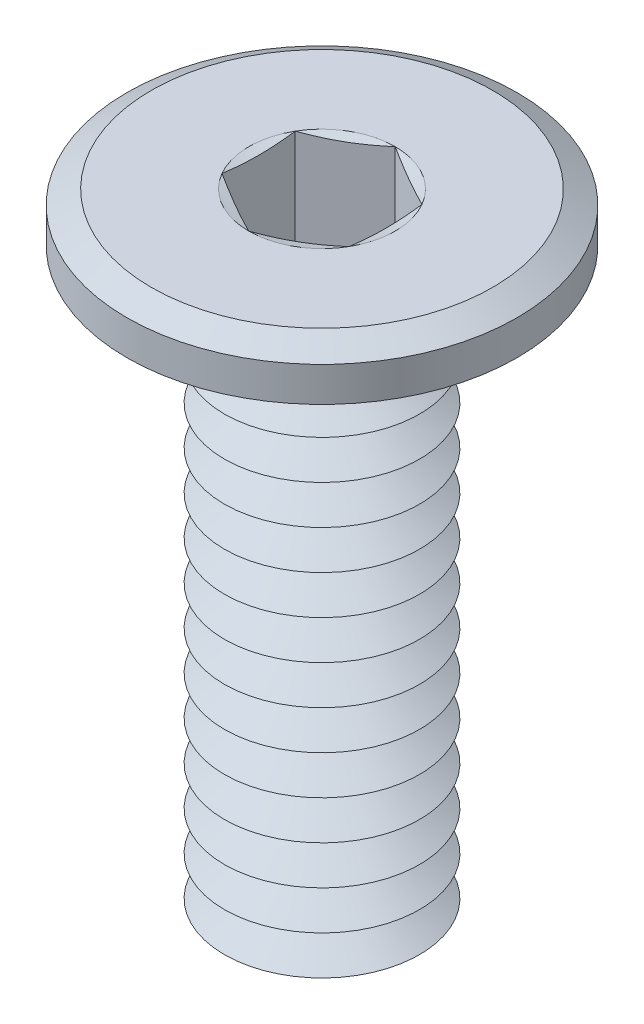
from build123d import *

# Parameters (mm, degrees)
SKETCH1_R           = 2
BOSS_EXTRUDE1_DEPTH = 0.5
SKETCH2_R           = 1
BOSS_EXTRUDE2_DEPTH = 6
LPATTERN1_COUNT     = 14
LPATTERN1_PITCH     = 0.4
FILLET1_R           = 0.1
CHAMFER2_SIZE       = 0.25
CHAMFER2_SIZE2      = 0.144337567
CUT_EXTRUDE1_DEPTH  = 1.2


with BuildPart() as part:
    # Sketch1 → Boss-Extrude1 (new body)
    with BuildSketch(Plane(origin=(0, 0, 0), x_dir=(1, 0, 0), z_dir=(0, 1, 0))):
        with Locations(Location((0, 0, 0), (0, 0, 270))):
            Circle(SKETCH1_R)
    extrude(amount=-BOSS_EXTRUDE1_DEPTH)

    # Sketch2 → Boss-Extrude2 (add)
    with BuildSketch(Plane.XZ.offset(0.5)):
        with Locations(Location((0, 0, 0), (0, 0, 270))):
            Circle(SKETCH2_R)
    extrude(amount=BOSS_EXTRUDE2_DEPTH)

    # Sketch5 → Cut-Revolve1 (revolve, cut)
    with BuildSketch(Plane(origin=(0, 0, 0), x_dir=(0, 0, -1), z_dir=(1, 0, 0))):
        Polygon((-1, -6.7), (-0.653589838, -6.5), (-1, -6.3), align=None)
    cut_revolve1 = revolve(axis=Axis((0, 0.990593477, 0), (0, -1, 0)), mode=Mode.SUBTRACT)

    # LPattern1: Cut-Revolve1 ×14
    with Locations(*[(0, i * LPATTERN1_PITCH, 0) for i in range(1, LPATTERN1_COUNT)]):
        add(cut_revolve1, mode=Mode.SUBTRACT)

    # Fillet1
    fillet1_edges = [part.edges().sort_by_distance(p)[0] for p in [
        (0, -0.5, 1),
    ]]
    fillet(fillet1_edges, radius=FILLET1_R)

    # Chamfer2
    chamfer2_edges = [part.edges().sort_by_distance(p)[0] for p in [
        (0, 0, -2),
    ]]
    chamfer2_side = [part.faces().sort_by_distance(p)[0] for p in [
        (0, 0, 0),
    ]]
    chamfer(chamfer2_edges, length=CHAMFER2_SIZE, length2=CHAMFER2_SIZE2, reference=chamfer2_side[0])

    # Sketch6 → Cut-Extrude1 (cut)
    with BuildSketch(Plane(origin=(0, 0, 0), x_dir=(1, 0, 0), z_dir=(0, 1, 0))):
        Polygon((0, 0.75055535), (-0.65, 0.375277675), (-0.65, -0.375277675), (0, -0.75055535), (0.65, -0.375277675), (0.65, 0.375277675), align=None)
    extrude(amount=-CUT_EXTRUDE1_DEPTH, mode=Mode.SUBTRACT)

    # Cut-Extrude2 cone 1 section (on through the dimple's axis) → Cut-Extrude2 (revolve, cut)
    with BuildSketch(Plane(origin=(0, -1.2, 0), x_dir=(0, 0, 1), z_dir=(1, 0, 0))):
        Polygon((0, 0), (0.65, 0), (0, 0.375277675), align=None)
    revolve(axis=Axis((0, -1.2, 0), (0, -1, 0)), mode=Mode.SUBTRACT)

    # Cut-Extrude3 cone 1 section (on through the dimple's axis) → Cut-Extrude3 (revolve, cut)
    with BuildSketch(Plane(origin=(0, 0, 0), x_dir=(0, 0, 1), z_dir=(1, 0, 0))):
        Polygon((0, 0), (0.75055535, 0), (0, 0.2011107), align=None)
    revolve(axis=Axis((0, 0, 0), (0, -1, 0)), mode=Mode.SUBTRACT)


solid = part.part
